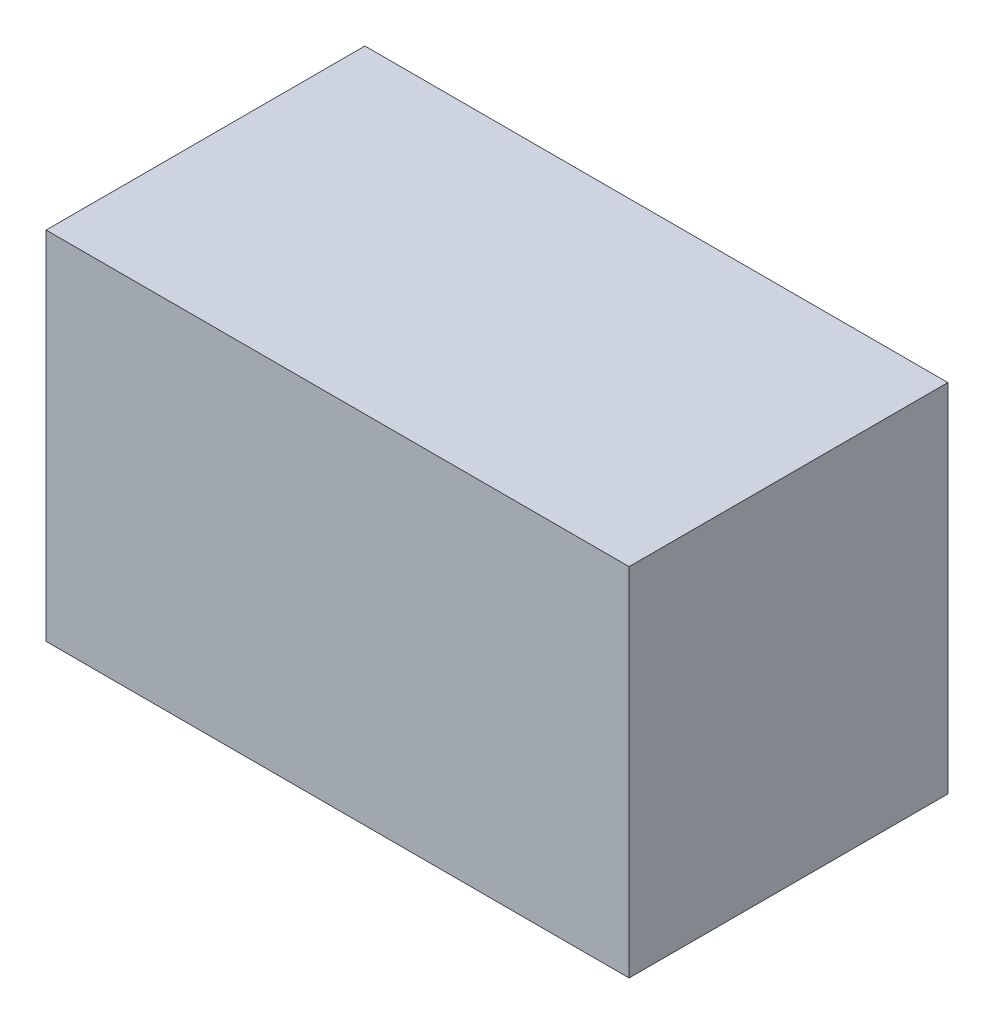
ISO-10303-21;
HEADER;
FILE_DESCRIPTION(('STEP AP214'),'2;1');
FILE_NAME('part.step','',(''),(''),'','','');
FILE_SCHEMA(('AUTOMOTIVE_DESIGN { 1 0 10303 214 1 1 1 1 }'));
ENDSEC;
DATA;
#1=APPLICATION_CONTEXT('core data for automotive mechanical design processes');
#2=APPLICATION_PROTOCOL_DEFINITION('international standard','automotive_design',2000,#1);
#3=PRODUCT_CONTEXT('',#1,'mechanical');
#4=PRODUCT('Part','Part','',(#3));
#5=PRODUCT_RELATED_PRODUCT_CATEGORY('part','',(#4));
#6=PRODUCT_DEFINITION_FORMATION('','',#4);
#7=PRODUCT_DEFINITION_CONTEXT('part definition',#1,'design');
#8=PRODUCT_DEFINITION('design','',#6,#7);
#9=PRODUCT_DEFINITION_SHAPE('','',#8);
#10=(LENGTH_UNIT() NAMED_UNIT(*) SI_UNIT(.MILLI.,.METRE.));
#11=(NAMED_UNIT(*) PLANE_ANGLE_UNIT() SI_UNIT($,.RADIAN.));
#12=(NAMED_UNIT(*) SI_UNIT($,.STERADIAN.) SOLID_ANGLE_UNIT());
#13=UNCERTAINTY_MEASURE_WITH_UNIT(LENGTH_MEASURE(1.E-05),#10,'distance_accuracy_value','');
#14=(GEOMETRIC_REPRESENTATION_CONTEXT(3) GLOBAL_UNCERTAINTY_ASSIGNED_CONTEXT((#13)) GLOBAL_UNIT_ASSIGNED_CONTEXT((#10,
#11,#12)) REPRESENTATION_CONTEXT('',''));
#15=CARTESIAN_POINT('',(0.,0.,0.));
#16=DIRECTION('',(0.,0.,1.));
#17=DIRECTION('',(1.,0.,0.));
#18=AXIS2_PLACEMENT_3D('',#15,#16,#17);
#19=CARTESIAN_POINT('',(-2.286,1.397,2.50000000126));
#20=DIRECTION('',(1.,0.,0.));
#21=DIRECTION('',(0.,0.,-1.));
#22=AXIS2_PLACEMENT_3D('',#19,#20,#21);
#23=PLANE('',#22);
#24=DIRECTION('',(0.,-1.,0.));
#25=VECTOR('',#24,1.);
#26=CARTESIAN_POINT('',(-2.286,1.397,0.));
#27=LINE('',#26,#25);
#28=CARTESIAN_POINT('',(-2.286,1.397,0.));
#29=VERTEX_POINT('',#28);
#30=CARTESIAN_POINT('',(-2.286,-1.397,0.));
#31=VERTEX_POINT('',#30);
#32=EDGE_CURVE('E96',#29,#31,#27,.T.);
#33=ORIENTED_EDGE('',*,*,#32,.T.);
#34=DIRECTION('',(0.,0.,-1.));
#35=VECTOR('',#34,1.);
#36=CARTESIAN_POINT('',(-2.286,-1.397,2.50000000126));
#37=LINE('',#36,#35);
#38=CARTESIAN_POINT('',(-2.286,-1.397,2.50000000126));
#39=VERTEX_POINT('',#38);
#40=EDGE_CURVE('E11',#39,#31,#37,.T.);
#41=ORIENTED_EDGE('',*,*,#40,.F.);
#42=DIRECTION('',(0.,-1.,0.));
#43=VECTOR('',#42,1.);
#44=CARTESIAN_POINT('',(-2.286,1.397,2.50000000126));
#45=LINE('',#44,#43);
#46=CARTESIAN_POINT('',(-2.286,1.397,2.50000000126));
#47=VERTEX_POINT('',#46);
#48=EDGE_CURVE('E84',#47,#39,#45,.T.);
#49=ORIENTED_EDGE('',*,*,#48,.F.);
#50=DIRECTION('',(0.,0.,-1.));
#51=VECTOR('',#50,1.);
#52=CARTESIAN_POINT('',(-2.286,1.397,2.50000000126));
#53=LINE('',#52,#51);
#54=EDGE_CURVE('E92',#47,#29,#53,.T.);
#55=ORIENTED_EDGE('',*,*,#54,.T.);
#56=EDGE_LOOP('',(#33,#41,#49,#55));
#57=FACE_BOUND('',#56,.T.);
#58=ADVANCED_FACE('F33',(#57),#23,.F.);
#59=CARTESIAN_POINT('',(-2.286,-1.397,2.50000000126));
#60=DIRECTION('',(0.,1.,0.));
#61=DIRECTION('',(0.,0.,1.));
#62=AXIS2_PLACEMENT_3D('',#59,#60,#61);
#63=PLANE('',#62);
#64=DIRECTION('',(1.,0.,0.));
#65=VECTOR('',#64,1.);
#66=CARTESIAN_POINT('',(-2.286,-1.397,0.));
#67=LINE('',#66,#65);
#68=CARTESIAN_POINT('',(2.286,-1.397,0.));
#69=VERTEX_POINT('',#68);
#70=EDGE_CURVE('E88',#31,#69,#67,.T.);
#71=ORIENTED_EDGE('',*,*,#70,.T.);
#72=DIRECTION('',(0.,0.,-1.));
#73=VECTOR('',#72,1.);
#74=CARTESIAN_POINT('',(2.286,-1.397,2.50000000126));
#75=LINE('',#74,#73);
#76=CARTESIAN_POINT('',(2.286,-1.397,2.50000000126));
#77=VERTEX_POINT('',#76);
#78=EDGE_CURVE('E41',#77,#69,#75,.T.);
#79=ORIENTED_EDGE('',*,*,#78,.F.);
#80=DIRECTION('',(1.,0.,0.));
#81=VECTOR('',#80,1.);
#82=CARTESIAN_POINT('',(-2.286,-1.397,2.50000000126));
#83=LINE('',#82,#81);
#84=EDGE_CURVE('E79',#39,#77,#83,.T.);
#85=ORIENTED_EDGE('',*,*,#84,.F.);
#86=ORIENTED_EDGE('',*,*,#40,.T.);
#87=EDGE_LOOP('',(#71,#79,#85,#86));
#88=FACE_BOUND('',#87,.T.);
#89=ADVANCED_FACE('F87',(#88),#63,.F.);
#90=CARTESIAN_POINT('',(2.286,-1.397,2.50000000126));
#91=DIRECTION('',(-1.,0.,0.));
#92=DIRECTION('',(0.,0.,1.));
#93=AXIS2_PLACEMENT_3D('',#90,#91,#92);
#94=PLANE('',#93);
#95=DIRECTION('',(0.,1.,0.));
#96=VECTOR('',#95,1.);
#97=CARTESIAN_POINT('',(2.286,-1.397,0.));
#98=LINE('',#97,#96);
#99=CARTESIAN_POINT('',(2.286,1.397,0.));
#100=VERTEX_POINT('',#99);
#101=EDGE_CURVE('E66',#69,#100,#98,.T.);
#102=ORIENTED_EDGE('',*,*,#101,.T.);
#103=DIRECTION('',(0.,0.,-1.));
#104=VECTOR('',#103,1.);
#105=CARTESIAN_POINT('',(2.286,1.397,2.50000000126));
#106=LINE('',#105,#104);
#107=CARTESIAN_POINT('',(2.286,1.397,2.50000000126));
#108=VERTEX_POINT('',#107);
#109=EDGE_CURVE('E89',#108,#100,#106,.T.);
#110=ORIENTED_EDGE('',*,*,#109,.F.);
#111=DIRECTION('',(0.,1.,0.));
#112=VECTOR('',#111,1.);
#113=CARTESIAN_POINT('',(2.286,-1.397,2.50000000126));
#114=LINE('',#113,#112);
#115=EDGE_CURVE('E82',#77,#108,#114,.T.);
#116=ORIENTED_EDGE('',*,*,#115,.F.);
#117=ORIENTED_EDGE('',*,*,#78,.T.);
#118=EDGE_LOOP('',(#102,#110,#116,#117));
#119=FACE_BOUND('',#118,.T.);
#120=ADVANCED_FACE('F90',(#119),#94,.F.);
#121=CARTESIAN_POINT('',(2.286,1.397,2.50000000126));
#122=DIRECTION('',(0.,-1.,0.));
#123=DIRECTION('',(0.,0.,-1.));
#124=AXIS2_PLACEMENT_3D('',#121,#122,#123);
#125=PLANE('',#124);
#126=DIRECTION('',(-1.,0.,0.));
#127=VECTOR('',#126,1.);
#128=CARTESIAN_POINT('',(2.286,1.397,0.));
#129=LINE('',#128,#127);
#130=EDGE_CURVE('E72',#100,#29,#129,.T.);
#131=ORIENTED_EDGE('',*,*,#130,.T.);
#132=ORIENTED_EDGE('',*,*,#54,.F.);
#133=DIRECTION('',(-1.,0.,0.));
#134=VECTOR('',#133,1.);
#135=CARTESIAN_POINT('',(2.286,1.397,2.50000000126));
#136=LINE('',#135,#134);
#137=EDGE_CURVE('E49',#108,#47,#136,.T.);
#138=ORIENTED_EDGE('',*,*,#137,.F.);
#139=ORIENTED_EDGE('',*,*,#109,.T.);
#140=EDGE_LOOP('',(#131,#132,#138,#139));
#141=FACE_BOUND('',#140,.T.);
#142=ADVANCED_FACE('F103',(#141),#125,.F.);
#143=CARTESIAN_POINT('',(0.,0.,2.50000000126));
#144=DIRECTION('',(0.,0.,1.));
#145=DIRECTION('',(1.,0.,0.));
#146=AXIS2_PLACEMENT_3D('',#143,#144,#145);
#147=PLANE('',#146);
#148=ORIENTED_EDGE('',*,*,#48,.T.);
#149=ORIENTED_EDGE('',*,*,#84,.T.);
#150=ORIENTED_EDGE('',*,*,#115,.T.);
#151=ORIENTED_EDGE('',*,*,#137,.T.);
#152=EDGE_LOOP('',(#148,#149,#150,#151));
#153=FACE_BOUND('',#152,.T.);
#154=ADVANCED_FACE('F80',(#153),#147,.T.);
#155=CARTESIAN_POINT('',(0.,0.,0.));
#156=DIRECTION('',(0.,0.,1.));
#157=DIRECTION('',(1.,0.,0.));
#158=AXIS2_PLACEMENT_3D('',#155,#156,#157);
#159=PLANE('',#158);
#160=ORIENTED_EDGE('',*,*,#32,.F.);
#161=ORIENTED_EDGE('',*,*,#130,.F.);
#162=ORIENTED_EDGE('',*,*,#101,.F.);
#163=ORIENTED_EDGE('',*,*,#70,.F.);
#164=EDGE_LOOP('',(#160,#161,#162,#163));
#165=FACE_BOUND('',#164,.T.);
#166=ADVANCED_FACE('F106',(#165),#159,.F.);
#167=CLOSED_SHELL('',(#58,#89,#120,#142,#154,#166));
#168=MANIFOLD_SOLID_BREP('B2',#167);
#169=ADVANCED_BREP_SHAPE_REPRESENTATION('',(#18,#168),#14);
#170=SHAPE_DEFINITION_REPRESENTATION(#9,#169);
ENDSEC;
END-ISO-10303-21;
